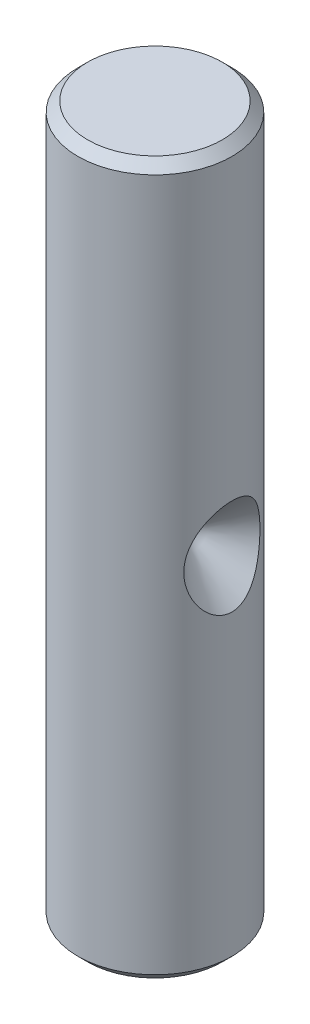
from build123d import *

# Parameters (mm, degrees)
ESQUISSE1_R      = 4
EXTRUSION1_DEPTH = 37
CHANFREIN1_SIZE  = 0.5


with BuildPart() as part:
    # Esquisse1 → Extrusion1 (new body)
    with BuildSketch(Plane(origin=(0, 0, 0), x_dir=(1, 0, 0), z_dir=(0, 1, 0))):
        with Locations(Location((0, 0, 0), (0, 0, 270))):
            Circle(ESQUISSE1_R)
    extrude(amount=EXTRUSION1_DEPTH)

    # Chanfrein1
    chanfrein1_edges = [part.edges().sort_by_distance(p)[0] for p in [
        (0, 0, -4),
        (0, 37, -4),
    ]]
    chamfer(chanfrein1_edges, length=CHANFREIN1_SIZE)

    # Esquisse3 → Enl_vement de mati_re-R_volution7 (revolve, cut)
    with BuildSketch(Plane.XY, mode=Mode.PRIVATE) as enl_vement_de_mati_re_r_volution7_sk:
        Polygon((1.5, 18.5), (5.302166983, 22.302166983), (5.302166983, 18.5), align=None)
    revolve(enl_vement_de_mati_re_r_volution7_sk.sketch.rotate(Axis((6.751846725, 18.5, 0), (-1, 0, 0)), 90), axis=Axis((6.751846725, 18.5, 0), (-1, 0, 0)), mode=Mode.SUBTRACT)


solid = part.part
